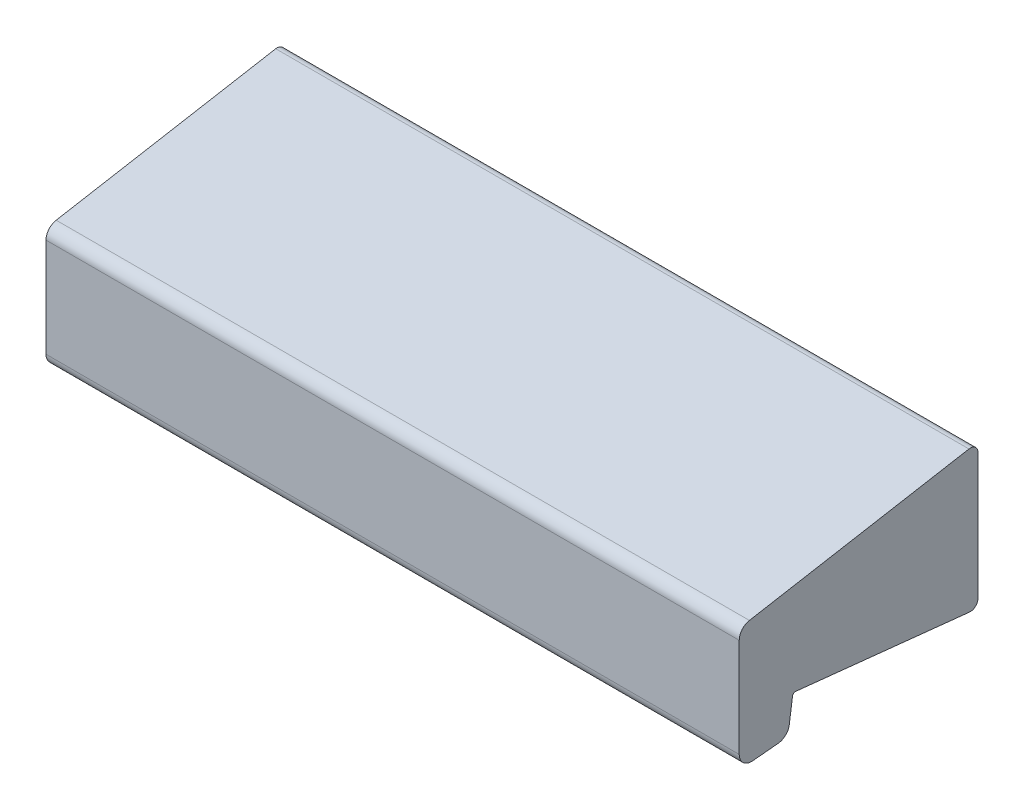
ISO-10303-21;
HEADER;
FILE_DESCRIPTION(('STEP AP214'),'2;1');
FILE_NAME('part.step','',(''),(''),'','','');
FILE_SCHEMA(('AUTOMOTIVE_DESIGN { 1 0 10303 214 1 1 1 1 }'));
ENDSEC;
DATA;
#1=APPLICATION_CONTEXT('core data for automotive mechanical design processes');
#2=APPLICATION_PROTOCOL_DEFINITION('international standard','automotive_design',2000,#1);
#3=PRODUCT_CONTEXT('',#1,'mechanical');
#4=PRODUCT('Part','Part','',(#3));
#5=PRODUCT_RELATED_PRODUCT_CATEGORY('part','',(#4));
#6=PRODUCT_DEFINITION_FORMATION('','',#4);
#7=PRODUCT_DEFINITION_CONTEXT('part definition',#1,'design');
#8=PRODUCT_DEFINITION('design','',#6,#7);
#9=PRODUCT_DEFINITION_SHAPE('','',#8);
#10=(LENGTH_UNIT() NAMED_UNIT(*) SI_UNIT(.MILLI.,.METRE.));
#11=(NAMED_UNIT(*) PLANE_ANGLE_UNIT() SI_UNIT($,.RADIAN.));
#12=(NAMED_UNIT(*) SI_UNIT($,.STERADIAN.) SOLID_ANGLE_UNIT());
#13=UNCERTAINTY_MEASURE_WITH_UNIT(LENGTH_MEASURE(1.E-05),#10,'distance_accuracy_value','');
#14=(GEOMETRIC_REPRESENTATION_CONTEXT(3) GLOBAL_UNCERTAINTY_ASSIGNED_CONTEXT((#13)) GLOBAL_UNIT_ASSIGNED_CONTEXT((#10,
#11,#12)) REPRESENTATION_CONTEXT('',''));
#15=CARTESIAN_POINT('',(0.,0.,0.));
#16=DIRECTION('',(0.,0.,1.));
#17=DIRECTION('',(1.,0.,0.));
#18=AXIS2_PLACEMENT_3D('',#15,#16,#17);
#19=CARTESIAN_POINT('',(-7.5,-4.1,0.5));
#20=DIRECTION('',(1.,0.,0.));
#21=DIRECTION('',(0.,0.,-1.));
#22=AXIS2_PLACEMENT_3D('',#19,#20,#21);
#23=CYLINDRICAL_SURFACE('',#22,0.5);
#24=CARTESIAN_POINT('',(37.5,-4.1,0.5));
#25=DIRECTION('',(1.,0.,0.));
#26=DIRECTION('',(0.,0.,1.));
#27=AXIS2_PLACEMENT_3D('',#24,#25,#26);
#28=CIRCLE('',#27,0.5);
#29=CARTESIAN_POINT('',(37.5,-4.59726094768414,0.552264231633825));
#30=VERTEX_POINT('',#29);
#31=CARTESIAN_POINT('',(37.5,-4.1,0.));
#32=VERTEX_POINT('',#31);
#33=EDGE_CURVE('E135',#30,#32,#28,.T.);
#34=ORIENTED_EDGE('',*,*,#33,.F.);
#35=DIRECTION('',(1.,0.,0.));
#36=VECTOR('',#35,1.);
#37=CARTESIAN_POINT('',(-7.5,-4.59726094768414,0.552264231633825));
#38=LINE('',#37,#36);
#39=CARTESIAN_POINT('',(-7.5,-4.59726094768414,0.552264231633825));
#40=VERTEX_POINT('',#39);
#41=EDGE_CURVE('E9',#40,#30,#38,.T.);
#42=ORIENTED_EDGE('',*,*,#41,.F.);
#43=CARTESIAN_POINT('',(-7.5,-4.1,0.5));
#44=DIRECTION('',(1.,0.,0.));
#45=DIRECTION('',(0.,0.,1.));
#46=AXIS2_PLACEMENT_3D('',#43,#44,#45);
#47=CIRCLE('',#46,0.5);
#48=CARTESIAN_POINT('',(-7.5,-4.1,0.));
#49=VERTEX_POINT('',#48);
#50=EDGE_CURVE('E168',#40,#49,#47,.T.);
#51=ORIENTED_EDGE('',*,*,#50,.T.);
#52=DIRECTION('',(1.,0.,0.));
#53=VECTOR('',#52,1.);
#54=CARTESIAN_POINT('',(-7.5,-4.1,0.));
#55=LINE('',#54,#53);
#56=EDGE_CURVE('E17',#49,#32,#55,.T.);
#57=ORIENTED_EDGE('',*,*,#56,.T.);
#58=EDGE_LOOP('',(#34,#42,#51,#57));
#59=FACE_BOUND('',#58,.T.);
#60=ADVANCED_FACE('F14',(#59),#23,.T.);
#61=CARTESIAN_POINT('',(-7.5,-4.59726094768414,0.552264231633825));
#62=DIRECTION('',(0.,-0.994521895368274,0.10452846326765));
#63=DIRECTION('',(0.,-0.10452846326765,-0.994521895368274));
#64=AXIS2_PLACEMENT_3D('',#61,#62,#63);
#65=PLANE('',#64);
#66=DIRECTION('',(0.,-0.10452846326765,-0.994521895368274));
#67=VECTOR('',#66,1.);
#68=CARTESIAN_POINT('',(37.5,-4.59726094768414,0.552264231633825));
#69=LINE('',#68,#67);
#70=CARTESIAN_POINT('',(37.5,-3.41281418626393,11.8215223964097));
#71=VERTEX_POINT('',#70);
#72=EDGE_CURVE('E166',#71,#30,#69,.T.);
#73=ORIENTED_EDGE('',*,*,#72,.F.);
#74=DIRECTION('',(1.,0.,0.));
#75=VECTOR('',#74,1.);
#76=CARTESIAN_POINT('',(-7.5,-3.41281418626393,11.8215223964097));
#77=LINE('',#76,#75);
#78=CARTESIAN_POINT('',(-7.5,-3.41281418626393,11.8215223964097));
#79=VERTEX_POINT('',#78);
#80=EDGE_CURVE('E23',#79,#71,#77,.T.);
#81=ORIENTED_EDGE('',*,*,#80,.F.);
#82=DIRECTION('',(0.,-0.10452846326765,-0.994521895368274));
#83=VECTOR('',#82,1.);
#84=CARTESIAN_POINT('',(-7.5,-4.59726094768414,0.552264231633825));
#85=LINE('',#84,#83);
#86=EDGE_CURVE('E125',#79,#40,#85,.T.);
#87=ORIENTED_EDGE('',*,*,#86,.T.);
#88=ORIENTED_EDGE('',*,*,#41,.T.);
#89=EDGE_LOOP('',(#73,#81,#87,#88));
#90=FACE_BOUND('',#89,.T.);
#91=ADVANCED_FACE('F188',(#90),#65,.T.);
#92=CARTESIAN_POINT('',(-7.5,-3.61171856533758,11.8424280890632));
#93=DIRECTION('',(1.,0.,0.));
#94=DIRECTION('',(0.,0.,-1.));
#95=AXIS2_PLACEMENT_3D('',#92,#93,#94);
#96=CYLINDRICAL_SURFACE('',#95,0.2);
#97=CARTESIAN_POINT('',(37.5,-3.61171856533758,11.8424280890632));
#98=DIRECTION('',(-1.,0.,0.));
#99=DIRECTION('',(0.,0.,1.));
#100=AXIS2_PLACEMENT_3D('',#97,#98,#99);
#101=CIRCLE('',#100,0.2);
#102=CARTESIAN_POINT('',(37.5,-3.58388394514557,12.0404817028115));
#103=VERTEX_POINT('',#102);
#104=EDGE_CURVE('E112',#103,#71,#101,.T.);
#105=ORIENTED_EDGE('',*,*,#104,.F.);
#106=DIRECTION('',(1.,0.,0.));
#107=VECTOR('',#106,1.);
#108=CARTESIAN_POINT('',(-7.5,-3.58388394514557,12.0404817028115));
#109=LINE('',#108,#107);
#110=CARTESIAN_POINT('',(-7.5,-3.58388394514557,12.0404817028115));
#111=VERTEX_POINT('',#110);
#112=EDGE_CURVE('E107',#111,#103,#109,.T.);
#113=ORIENTED_EDGE('',*,*,#112,.F.);
#114=CARTESIAN_POINT('',(-7.5,-3.61171856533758,11.8424280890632));
#115=DIRECTION('',(-1.,0.,0.));
#116=DIRECTION('',(0.,0.,1.));
#117=AXIS2_PLACEMENT_3D('',#114,#115,#116);
#118=CIRCLE('',#117,0.2);
#119=EDGE_CURVE('E110',#111,#79,#118,.T.);
#120=ORIENTED_EDGE('',*,*,#119,.T.);
#121=ORIENTED_EDGE('',*,*,#80,.T.);
#122=EDGE_LOOP('',(#105,#113,#120,#121));
#123=FACE_BOUND('',#122,.T.);
#124=ADVANCED_FACE('F109',(#123),#96,.F.);
#125=CARTESIAN_POINT('',(-7.5,-3.58388394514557,12.0404817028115));
#126=DIRECTION('',(0.,-0.139173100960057,-0.990268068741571));
#127=DIRECTION('',(0.,0.990268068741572,-0.139173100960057));
#128=AXIS2_PLACEMENT_3D('',#125,#126,#127);
#129=PLANE('',#128);
#130=DIRECTION('',(0.,0.990268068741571,-0.139173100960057));
#131=VECTOR('',#130,1.);
#132=CARTESIAN_POINT('',(37.5,-3.58388394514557,12.0404817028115));
#133=LINE('',#132,#131);
#134=CARTESIAN_POINT('',(37.5,-5.0807720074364,12.2508556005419));
#135=VERTEX_POINT('',#134);
#136=EDGE_CURVE('E163',#135,#103,#133,.T.);
#137=ORIENTED_EDGE('',*,*,#136,.F.);
#138=DIRECTION('',(1.,0.,0.));
#139=VECTOR('',#138,1.);
#140=CARTESIAN_POINT('',(-7.5,-5.0807720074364,12.2508556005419));
#141=LINE('',#140,#139);
#142=CARTESIAN_POINT('',(-7.5,-5.0807720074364,12.2508556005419));
#143=VERTEX_POINT('',#142);
#144=EDGE_CURVE('E117',#143,#135,#141,.T.);
#145=ORIENTED_EDGE('',*,*,#144,.F.);
#146=DIRECTION('',(0.,0.990268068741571,-0.139173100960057));
#147=VECTOR('',#146,1.);
#148=CARTESIAN_POINT('',(-7.5,-3.58388394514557,12.0404817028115));
#149=LINE('',#148,#147);
#150=EDGE_CURVE('E123',#143,#111,#149,.T.);
#151=ORIENTED_EDGE('',*,*,#150,.T.);
#152=ORIENTED_EDGE('',*,*,#112,.T.);
#153=EDGE_LOOP('',(#137,#145,#151,#152));
#154=FACE_BOUND('',#153,.T.);
#155=ADVANCED_FACE('F127',(#154),#129,.T.);
#156=CARTESIAN_POINT('',(-7.5,-4.96943352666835,13.0430700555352));
#157=DIRECTION('',(1.,0.,0.));
#158=DIRECTION('',(0.,0.,-1.));
#159=AXIS2_PLACEMENT_3D('',#156,#157,#158);
#160=CYLINDRICAL_SURFACE('',#159,0.8);
#161=CARTESIAN_POINT('',(37.5,-4.96943352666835,13.0430700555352));
#162=DIRECTION('',(1.,0.,0.));
#163=DIRECTION('',(0.,0.,1.));
#164=AXIS2_PLACEMENT_3D('',#161,#162,#163);
#165=CIRCLE('',#164,0.8);
#166=CARTESIAN_POINT('',(37.5,-5.76597138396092,12.9687232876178));
#167=VERTEX_POINT('',#166);
#168=EDGE_CURVE('E160',#167,#135,#165,.T.);
#169=ORIENTED_EDGE('',*,*,#168,.F.);
#170=DIRECTION('',(1.,0.,0.));
#171=VECTOR('',#170,1.);
#172=CARTESIAN_POINT('',(-7.5,-5.76597138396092,12.9687232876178));
#173=LINE('',#172,#171);
#174=CARTESIAN_POINT('',(-7.5,-5.76597138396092,12.9687232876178));
#175=VERTEX_POINT('',#174);
#176=EDGE_CURVE('E172',#175,#167,#173,.T.);
#177=ORIENTED_EDGE('',*,*,#176,.F.);
#178=CARTESIAN_POINT('',(-7.5,-4.96943352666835,13.0430700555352));
#179=DIRECTION('',(1.,0.,0.));
#180=DIRECTION('',(0.,0.,1.));
#181=AXIS2_PLACEMENT_3D('',#178,#179,#180);
#182=CIRCLE('',#181,0.8);
#183=EDGE_CURVE('E128',#175,#143,#182,.T.);
#184=ORIENTED_EDGE('',*,*,#183,.T.);
#185=ORIENTED_EDGE('',*,*,#144,.T.);
#186=EDGE_LOOP('',(#169,#177,#184,#185));
#187=FACE_BOUND('',#186,.T.);
#188=ADVANCED_FACE('F203',(#187),#160,.T.);
#189=CARTESIAN_POINT('',(-7.5,-5.76597138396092,12.9687232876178));
#190=DIRECTION('',(0.,-0.995672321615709,-0.0929334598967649));
#191=DIRECTION('',(0.,0.0929334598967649,-0.995672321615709));
#192=AXIS2_PLACEMENT_3D('',#189,#190,#191);
#193=PLANE('',#192);
#194=DIRECTION('',(0.,0.0929334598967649,-0.995672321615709));
#195=VECTOR('',#194,1.);
#196=CARTESIAN_POINT('',(37.5,-5.76597138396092,12.9687232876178));
#197=LINE('',#196,#195);
#198=CARTESIAN_POINT('',(37.5,-5.92062490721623,14.6256532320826));
#199=VERTEX_POINT('',#198);
#200=EDGE_CURVE('E157',#199,#167,#197,.T.);
#201=ORIENTED_EDGE('',*,*,#200,.F.);
#202=DIRECTION('',(1.,0.,0.));
#203=VECTOR('',#202,1.);
#204=CARTESIAN_POINT('',(-7.5,-5.92062490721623,14.6256532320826));
#205=LINE('',#204,#203);
#206=CARTESIAN_POINT('',(-7.5,-5.92062490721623,14.6256532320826));
#207=VERTEX_POINT('',#206);
#208=EDGE_CURVE('E174',#207,#199,#205,.T.);
#209=ORIENTED_EDGE('',*,*,#208,.F.);
#210=DIRECTION('',(0.,0.0929334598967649,-0.995672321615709));
#211=VECTOR('',#210,1.);
#212=CARTESIAN_POINT('',(-7.5,-5.76597138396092,12.9687232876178));
#213=LINE('',#212,#211);
#214=EDGE_CURVE('E130',#207,#175,#213,.T.);
#215=ORIENTED_EDGE('',*,*,#214,.T.);
#216=ORIENTED_EDGE('',*,*,#176,.T.);
#217=EDGE_LOOP('',(#201,#209,#215,#216));
#218=FACE_BOUND('',#217,.T.);
#219=ADVANCED_FACE('F206',(#218),#193,.T.);
#220=CARTESIAN_POINT('',(-7.5,-5.12408704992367,14.7));
#221=DIRECTION('',(1.,0.,0.));
#222=DIRECTION('',(0.,0.,-1.));
#223=AXIS2_PLACEMENT_3D('',#220,#221,#222);
#224=CYLINDRICAL_SURFACE('',#223,0.8);
#225=CARTESIAN_POINT('',(37.5,-5.12408704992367,14.7));
#226=DIRECTION('',(1.,0.,0.));
#227=DIRECTION('',(0.,0.,-1.));
#228=AXIS2_PLACEMENT_3D('',#225,#226,#227);
#229=CIRCLE('',#228,0.8);
#230=CARTESIAN_POINT('',(37.5,-5.12408704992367,15.5));
#231=VERTEX_POINT('',#230);
#232=EDGE_CURVE('E154',#231,#199,#229,.T.);
#233=ORIENTED_EDGE('',*,*,#232,.F.);
#234=DIRECTION('',(1.,0.,0.));
#235=VECTOR('',#234,1.);
#236=CARTESIAN_POINT('',(-7.5,-5.12408704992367,15.5));
#237=LINE('',#236,#235);
#238=CARTESIAN_POINT('',(-7.5,-5.12408704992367,15.5));
#239=VERTEX_POINT('',#238);
#240=EDGE_CURVE('E176',#239,#231,#237,.T.);
#241=ORIENTED_EDGE('',*,*,#240,.F.);
#242=CARTESIAN_POINT('',(-7.5,-5.12408704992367,14.7));
#243=DIRECTION('',(1.,0.,0.));
#244=DIRECTION('',(0.,0.,-1.));
#245=AXIS2_PLACEMENT_3D('',#242,#243,#244);
#246=CIRCLE('',#245,0.8);
#247=EDGE_CURVE('E265',#239,#207,#246,.T.);
#248=ORIENTED_EDGE('',*,*,#247,.T.);
#249=ORIENTED_EDGE('',*,*,#208,.T.);
#250=EDGE_LOOP('',(#233,#241,#248,#249));
#251=FACE_BOUND('',#250,.T.);
#252=ADVANCED_FACE('F210',(#251),#224,.T.);
#253=CARTESIAN_POINT('',(-7.5,-5.12408704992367,15.5));
#254=DIRECTION('',(0.,0.,1.));
#255=DIRECTION('',(0.,-1.,0.));
#256=AXIS2_PLACEMENT_3D('',#253,#254,#255);
#257=PLANE('',#256);
#258=DIRECTION('',(0.,-1.,0.));
#259=VECTOR('',#258,1.);
#260=CARTESIAN_POINT('',(37.5,-5.12408704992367,15.5));
#261=LINE('',#260,#259);
#262=CARTESIAN_POINT('',(37.5,1.291528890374,15.5));
#263=VERTEX_POINT('',#262);
#264=EDGE_CURVE('E151',#263,#231,#261,.T.);
#265=ORIENTED_EDGE('',*,*,#264,.F.);
#266=DIRECTION('',(1.,0.,0.));
#267=VECTOR('',#266,1.);
#268=CARTESIAN_POINT('',(-7.5,1.291528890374,15.5));
#269=LINE('',#268,#267);
#270=CARTESIAN_POINT('',(-7.5,1.291528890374,15.5));
#271=VERTEX_POINT('',#270);
#272=EDGE_CURVE('E178',#271,#263,#269,.T.);
#273=ORIENTED_EDGE('',*,*,#272,.F.);
#274=DIRECTION('',(0.,-1.,0.));
#275=VECTOR('',#274,1.);
#276=CARTESIAN_POINT('',(-7.5,-5.12408704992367,15.5));
#277=LINE('',#276,#275);
#278=EDGE_CURVE('E262',#271,#239,#277,.T.);
#279=ORIENTED_EDGE('',*,*,#278,.T.);
#280=ORIENTED_EDGE('',*,*,#240,.T.);
#281=EDGE_LOOP('',(#265,#273,#279,#280));
#282=FACE_BOUND('',#281,.T.);
#283=ADVANCED_FACE('F214',(#282),#257,.T.);
#284=CARTESIAN_POINT('',(-7.5,1.291528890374,14.7));
#285=DIRECTION('',(1.,0.,0.));
#286=DIRECTION('',(0.,0.,-1.));
#287=AXIS2_PLACEMENT_3D('',#284,#285,#286);
#288=CYLINDRICAL_SURFACE('',#287,0.8);
#289=CARTESIAN_POINT('',(37.5,1.291528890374,14.7));
#290=DIRECTION('',(1.,0.,0.));
#291=DIRECTION('',(0.,0.,1.));
#292=AXIS2_PLACEMENT_3D('',#289,#290,#291);
#293=CIRCLE('',#292,0.8);
#294=CARTESIAN_POINT('',(37.5,2.07937509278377,14.8389185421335));
#295=VERTEX_POINT('',#294);
#296=EDGE_CURVE('E148',#295,#263,#293,.T.);
#297=ORIENTED_EDGE('',*,*,#296,.F.);
#298=DIRECTION('',(1.,0.,0.));
#299=VECTOR('',#298,1.);
#300=CARTESIAN_POINT('',(-7.5,2.07937509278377,14.8389185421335));
#301=LINE('',#300,#299);
#302=CARTESIAN_POINT('',(-7.5,2.07937509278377,14.8389185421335));
#303=VERTEX_POINT('',#302);
#304=EDGE_CURVE('E180',#303,#295,#301,.T.);
#305=ORIENTED_EDGE('',*,*,#304,.F.);
#306=CARTESIAN_POINT('',(-7.5,1.291528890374,14.7));
#307=DIRECTION('',(1.,0.,0.));
#308=DIRECTION('',(0.,0.,1.));
#309=AXIS2_PLACEMENT_3D('',#306,#307,#308);
#310=CIRCLE('',#309,0.8);
#311=EDGE_CURVE('E259',#303,#271,#310,.T.);
#312=ORIENTED_EDGE('',*,*,#311,.T.);
#313=ORIENTED_EDGE('',*,*,#272,.T.);
#314=EDGE_LOOP('',(#297,#305,#312,#313));
#315=FACE_BOUND('',#314,.T.);
#316=ADVANCED_FACE('F218',(#315),#288,.T.);
#317=CARTESIAN_POINT('',(-7.5,4.5924038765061,0.586824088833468));
#318=DIRECTION('',(0.,0.984807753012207,0.173648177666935));
#319=DIRECTION('',(0.,-0.173648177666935,0.984807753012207));
#320=AXIS2_PLACEMENT_3D('',#317,#318,#319);
#321=PLANE('',#320);
#322=DIRECTION('',(0.,-0.173648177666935,0.984807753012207));
#323=VECTOR('',#322,1.);
#324=CARTESIAN_POINT('',(37.5,4.5924038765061,0.586824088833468));
#325=LINE('',#324,#323);
#326=CARTESIAN_POINT('',(37.5,4.5924038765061,0.586824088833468));
#327=VERTEX_POINT('',#326);
#328=EDGE_CURVE('E145',#327,#295,#325,.T.);
#329=ORIENTED_EDGE('',*,*,#328,.F.);
#330=DIRECTION('',(1.,0.,0.));
#331=VECTOR('',#330,1.);
#332=CARTESIAN_POINT('',(-7.5,4.5924038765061,0.586824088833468));
#333=LINE('',#332,#331);
#334=CARTESIAN_POINT('',(-7.5,4.5924038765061,0.586824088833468));
#335=VERTEX_POINT('',#334);
#336=EDGE_CURVE('E182',#335,#327,#333,.T.);
#337=ORIENTED_EDGE('',*,*,#336,.F.);
#338=DIRECTION('',(0.,-0.173648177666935,0.984807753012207));
#339=VECTOR('',#338,1.);
#340=CARTESIAN_POINT('',(-7.5,4.5924038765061,0.586824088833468));
#341=LINE('',#340,#339);
#342=EDGE_CURVE('E256',#335,#303,#341,.T.);
#343=ORIENTED_EDGE('',*,*,#342,.T.);
#344=ORIENTED_EDGE('',*,*,#304,.T.);
#345=EDGE_LOOP('',(#329,#337,#343,#344));
#346=FACE_BOUND('',#345,.T.);
#347=ADVANCED_FACE('F222',(#346),#321,.T.);
#348=CARTESIAN_POINT('',(-7.5,4.1,0.5));
#349=DIRECTION('',(1.,0.,0.));
#350=DIRECTION('',(0.,0.,-1.));
#351=AXIS2_PLACEMENT_3D('',#348,#349,#350);
#352=CYLINDRICAL_SURFACE('',#351,0.5);
#353=CARTESIAN_POINT('',(37.5,4.1,0.5));
#354=DIRECTION('',(1.,0.,0.));
#355=DIRECTION('',(0.,0.,1.));
#356=AXIS2_PLACEMENT_3D('',#353,#354,#355);
#357=CIRCLE('',#356,0.5);
#358=CARTESIAN_POINT('',(37.5,4.1,0.));
#359=VERTEX_POINT('',#358);
#360=EDGE_CURVE('E142',#359,#327,#357,.T.);
#361=ORIENTED_EDGE('',*,*,#360,.F.);
#362=DIRECTION('',(1.,0.,0.));
#363=VECTOR('',#362,1.);
#364=CARTESIAN_POINT('',(-7.5,4.1,0.));
#365=LINE('',#364,#363);
#366=CARTESIAN_POINT('',(-7.5,4.1,0.));
#367=VERTEX_POINT('',#366);
#368=EDGE_CURVE('E183',#367,#359,#365,.T.);
#369=ORIENTED_EDGE('',*,*,#368,.F.);
#370=CARTESIAN_POINT('',(-7.5,4.1,0.5));
#371=DIRECTION('',(1.,0.,0.));
#372=DIRECTION('',(0.,0.,1.));
#373=AXIS2_PLACEMENT_3D('',#370,#371,#372);
#374=CIRCLE('',#373,0.5);
#375=EDGE_CURVE('E253',#367,#335,#374,.T.);
#376=ORIENTED_EDGE('',*,*,#375,.T.);
#377=ORIENTED_EDGE('',*,*,#336,.T.);
#378=EDGE_LOOP('',(#361,#369,#376,#377));
#379=FACE_BOUND('',#378,.T.);
#380=ADVANCED_FACE('F226',(#379),#352,.T.);
#381=CARTESIAN_POINT('',(-7.5,-4.1,0.));
#382=DIRECTION('',(0.,0.,-1.));
#383=DIRECTION('',(-1.,0.,0.));
#384=AXIS2_PLACEMENT_3D('',#381,#382,#383);
#385=PLANE('',#384);
#386=CARTESIAN_POINT('',(0.,0.,0.));
#387=DIRECTION('',(0.,0.,-1.));
#388=DIRECTION('',(-1.,0.,0.));
#389=AXIS2_PLACEMENT_3D('',#386,#387,#388);
#390=CIRCLE('',#389,2.);
#391=CARTESIAN_POINT('',(-2.,0.,0.));
#392=VERTEX_POINT('',#391);
#393=EDGE_CURVE('E239',#392,#392,#390,.T.);
#394=ORIENTED_EDGE('',*,*,#393,.F.);
#395=EDGE_LOOP('',(#394));
#396=FACE_BOUND('',#395,.T.);
#397=CARTESIAN_POINT('',(30.,0.,0.));
#398=DIRECTION('',(0.,0.,-1.));
#399=DIRECTION('',(-1.,0.,0.));
#400=AXIS2_PLACEMENT_3D('',#397,#398,#399);
#401=CIRCLE('',#400,2.);
#402=CARTESIAN_POINT('',(28.,0.,0.));
#403=VERTEX_POINT('',#402);
#404=EDGE_CURVE('E242',#403,#403,#401,.T.);
#405=ORIENTED_EDGE('',*,*,#404,.F.);
#406=EDGE_LOOP('',(#405));
#407=FACE_BOUND('',#406,.T.);
#408=DIRECTION('',(0.,1.,0.));
#409=VECTOR('',#408,1.);
#410=CARTESIAN_POINT('',(37.5,-4.1,0.));
#411=LINE('',#410,#409);
#412=EDGE_CURVE('E138',#32,#359,#411,.T.);
#413=ORIENTED_EDGE('',*,*,#412,.F.);
#414=ORIENTED_EDGE('',*,*,#56,.F.);
#415=DIRECTION('',(0.,1.,0.));
#416=VECTOR('',#415,1.);
#417=CARTESIAN_POINT('',(-7.5,-4.1,0.));
#418=LINE('',#417,#416);
#419=EDGE_CURVE('E251',#49,#367,#418,.T.);
#420=ORIENTED_EDGE('',*,*,#419,.T.);
#421=ORIENTED_EDGE('',*,*,#368,.T.);
#422=EDGE_LOOP('',(#413,#414,#420,#421));
#423=FACE_BOUND('',#422,.T.);
#424=ADVANCED_FACE('F185',(#396,#407,#423),#385,.T.);
#425=CARTESIAN_POINT('',(-7.5,-4.1,0.5));
#426=DIRECTION('',(-1.,0.,0.));
#427=DIRECTION('',(0.,0.,1.));
#428=AXIS2_PLACEMENT_3D('',#425,#426,#427);
#429=PLANE('',#428);
#430=ORIENTED_EDGE('',*,*,#50,.F.);
#431=ORIENTED_EDGE('',*,*,#86,.F.);
#432=ORIENTED_EDGE('',*,*,#119,.F.);
#433=ORIENTED_EDGE('',*,*,#150,.F.);
#434=ORIENTED_EDGE('',*,*,#183,.F.);
#435=ORIENTED_EDGE('',*,*,#214,.F.);
#436=ORIENTED_EDGE('',*,*,#247,.F.);
#437=ORIENTED_EDGE('',*,*,#278,.F.);
#438=ORIENTED_EDGE('',*,*,#311,.F.);
#439=ORIENTED_EDGE('',*,*,#342,.F.);
#440=ORIENTED_EDGE('',*,*,#375,.F.);
#441=ORIENTED_EDGE('',*,*,#419,.F.);
#442=EDGE_LOOP('',(#430,#431,#432,#433,#434,#435,#436,#437,#438,#439,#440,#441));
#443=FACE_BOUND('',#442,.T.);
#444=ADVANCED_FACE('F121',(#443),#429,.T.);
#445=CARTESIAN_POINT('',(37.5,-4.1,0.5));
#446=DIRECTION('',(-1.,0.,0.));
#447=DIRECTION('',(0.,0.,1.));
#448=AXIS2_PLACEMENT_3D('',#445,#446,#447);
#449=PLANE('',#448);
#450=ORIENTED_EDGE('',*,*,#33,.T.);
#451=ORIENTED_EDGE('',*,*,#412,.T.);
#452=ORIENTED_EDGE('',*,*,#360,.T.);
#453=ORIENTED_EDGE('',*,*,#328,.T.);
#454=ORIENTED_EDGE('',*,*,#296,.T.);
#455=ORIENTED_EDGE('',*,*,#264,.T.);
#456=ORIENTED_EDGE('',*,*,#232,.T.);
#457=ORIENTED_EDGE('',*,*,#200,.T.);
#458=ORIENTED_EDGE('',*,*,#168,.T.);
#459=ORIENTED_EDGE('',*,*,#136,.T.);
#460=ORIENTED_EDGE('',*,*,#104,.T.);
#461=ORIENTED_EDGE('',*,*,#72,.T.);
#462=EDGE_LOOP('',(#450,#451,#452,#453,#454,#455,#456,#457,#458,#459,#460,#461));
#463=FACE_BOUND('',#462,.T.);
#464=ADVANCED_FACE('F187',(#463),#449,.F.);
#465=CARTESIAN_POINT('',(30.,0.,8.));
#466=DIRECTION('',(0.,0.,-1.));
#467=DIRECTION('',(-1.,0.,0.));
#468=AXIS2_PLACEMENT_3D('',#465,#466,#467);
#469=CYLINDRICAL_SURFACE('',#468,2.);
#470=CARTESIAN_POINT('',(30.,0.,8.));
#471=DIRECTION('',(0.,0.,-1.));
#472=DIRECTION('',(-1.,0.,0.));
#473=AXIS2_PLACEMENT_3D('',#470,#471,#472);
#474=CIRCLE('',#473,2.);
#475=CARTESIAN_POINT('',(28.,0.,8.));
#476=VERTEX_POINT('',#475);
#477=EDGE_CURVE('E244',#476,#476,#474,.T.);
#478=ORIENTED_EDGE('',*,*,#477,.F.);
#479=EDGE_LOOP('',(#478));
#480=FACE_BOUND('',#479,.T.);
#481=ORIENTED_EDGE('',*,*,#404,.T.);
#482=EDGE_LOOP('',(#481));
#483=FACE_BOUND('',#482,.T.);
#484=ADVANCED_FACE('F297',(#480,#483),#469,.F.);
#485=CARTESIAN_POINT('',(30.,0.,8.));
#486=DIRECTION('',(0.,0.,-1.));
#487=DIRECTION('',(-1.,0.,0.));
#488=AXIS2_PLACEMENT_3D('',#485,#486,#487);
#489=PLANE('',#488);
#490=ORIENTED_EDGE('',*,*,#477,.T.);
#491=EDGE_LOOP('',(#490));
#492=FACE_BOUND('',#491,.T.);
#493=ADVANCED_FACE('F289',(#492),#489,.T.);
#494=CARTESIAN_POINT('',(0.,0.,8.));
#495=DIRECTION('',(0.,0.,-1.));
#496=DIRECTION('',(-1.,0.,0.));
#497=AXIS2_PLACEMENT_3D('',#494,#495,#496);
#498=CYLINDRICAL_SURFACE('',#497,2.);
#499=CARTESIAN_POINT('',(0.,0.,8.));
#500=DIRECTION('',(0.,0.,-1.));
#501=DIRECTION('',(-1.,0.,0.));
#502=AXIS2_PLACEMENT_3D('',#499,#500,#501);
#503=CIRCLE('',#502,2.);
#504=CARTESIAN_POINT('',(-2.,0.,8.));
#505=VERTEX_POINT('',#504);
#506=EDGE_CURVE('E139',#505,#505,#503,.T.);
#507=ORIENTED_EDGE('',*,*,#506,.F.);
#508=EDGE_LOOP('',(#507));
#509=FACE_BOUND('',#508,.T.);
#510=ORIENTED_EDGE('',*,*,#393,.T.);
#511=EDGE_LOOP('',(#510));
#512=FACE_BOUND('',#511,.T.);
#513=ADVANCED_FACE('F286',(#509,#512),#498,.F.);
#514=CARTESIAN_POINT('',(0.,0.,8.));
#515=DIRECTION('',(0.,0.,-1.));
#516=DIRECTION('',(-1.,0.,0.));
#517=AXIS2_PLACEMENT_3D('',#514,#515,#516);
#518=PLANE('',#517);
#519=ORIENTED_EDGE('',*,*,#506,.T.);
#520=EDGE_LOOP('',(#519));
#521=FACE_BOUND('',#520,.T.);
#522=ADVANCED_FACE('F284',(#521),#518,.T.);
#523=CLOSED_SHELL('',(#60,#91,#124,#155,#188,#219,#252,#283,#316,#347,#380,#424,#444,#464,#484,
#493,#513,#522));
#524=MANIFOLD_SOLID_BREP('B1',#523);
#525=ADVANCED_BREP_SHAPE_REPRESENTATION('',(#18,#524),#14);
#526=SHAPE_DEFINITION_REPRESENTATION(#9,#525);
ENDSEC;
END-ISO-10303-21;
